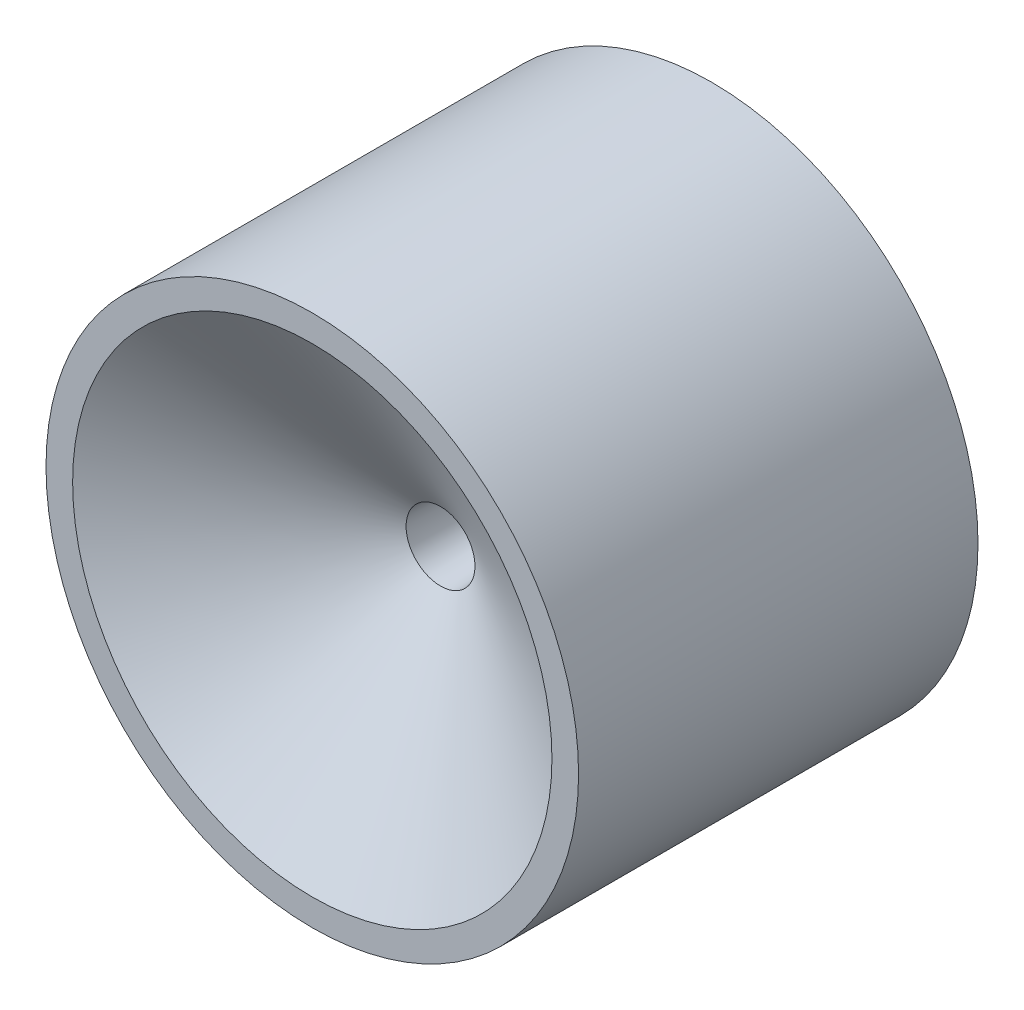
ISO-10303-21;
HEADER;
FILE_DESCRIPTION(('STEP AP214'),'2;1');
FILE_NAME('part.step','',(''),(''),'','','');
FILE_SCHEMA(('AUTOMOTIVE_DESIGN { 1 0 10303 214 1 1 1 1 }'));
ENDSEC;
DATA;
#1=APPLICATION_CONTEXT('core data for automotive mechanical design processes');
#2=APPLICATION_PROTOCOL_DEFINITION('international standard','automotive_design',2000,#1);
#3=PRODUCT_CONTEXT('',#1,'mechanical');
#4=PRODUCT('Part','Part','',(#3));
#5=PRODUCT_RELATED_PRODUCT_CATEGORY('part','',(#4));
#6=PRODUCT_DEFINITION_FORMATION('','',#4);
#7=PRODUCT_DEFINITION_CONTEXT('part definition',#1,'design');
#8=PRODUCT_DEFINITION('design','',#6,#7);
#9=PRODUCT_DEFINITION_SHAPE('','',#8);
#10=(LENGTH_UNIT() NAMED_UNIT(*) SI_UNIT(.MILLI.,.METRE.));
#11=(NAMED_UNIT(*) PLANE_ANGLE_UNIT() SI_UNIT($,.RADIAN.));
#12=(NAMED_UNIT(*) SI_UNIT($,.STERADIAN.) SOLID_ANGLE_UNIT());
#13=UNCERTAINTY_MEASURE_WITH_UNIT(LENGTH_MEASURE(1.E-05),#10,'distance_accuracy_value','');
#14=(GEOMETRIC_REPRESENTATION_CONTEXT(3) GLOBAL_UNCERTAINTY_ASSIGNED_CONTEXT((#13)) GLOBAL_UNIT_ASSIGNED_CONTEXT((#10,
#11,#12)) REPRESENTATION_CONTEXT('',''));
#15=CARTESIAN_POINT('',(0.,0.,0.));
#16=DIRECTION('',(0.,0.,1.));
#17=DIRECTION('',(1.,0.,0.));
#18=AXIS2_PLACEMENT_3D('',#15,#16,#17);
#19=CARTESIAN_POINT('',(0.,0.,0.));
#20=DIRECTION('',(0.,0.,1.));
#21=DIRECTION('',(1.,0.,0.));
#22=AXIS2_PLACEMENT_3D('',#19,#20,#21);
#23=PLANE('',#22);
#24=CARTESIAN_POINT('',(0.,0.,0.));
#25=DIRECTION('',(0.,0.,1.));
#26=DIRECTION('',(1.,0.,0.));
#27=AXIS2_PLACEMENT_3D('',#24,#25,#26);
#28=CIRCLE('',#27,3.4);
#29=CARTESIAN_POINT('',(3.4,0.,0.));
#30=VERTEX_POINT('',#29);
#31=EDGE_CURVE('E46',#30,#30,#28,.T.);
#32=ORIENTED_EDGE('',*,*,#31,.T.);
#33=EDGE_LOOP('',(#32));
#34=FACE_BOUND('',#33,.T.);
#35=CARTESIAN_POINT('',(0.,0.,0.));
#36=DIRECTION('',(0.,0.,-1.));
#37=DIRECTION('',(-1.,0.,0.));
#38=AXIS2_PLACEMENT_3D('',#35,#36,#37);
#39=CIRCLE('',#38,5.5);
#40=CARTESIAN_POINT('',(-5.5,0.,0.));
#41=VERTEX_POINT('',#40);
#42=EDGE_CURVE('E64',#41,#41,#39,.T.);
#43=ORIENTED_EDGE('',*,*,#42,.T.);
#44=EDGE_LOOP('',(#43));
#45=FACE_BOUND('',#44,.T.);
#46=ADVANCED_FACE('F31',(#34,#45),#23,.F.);
#47=CARTESIAN_POINT('',(0.,0.,0.));
#48=DIRECTION('',(0.,0.,-1.));
#49=DIRECTION('',(-1.,0.,0.));
#50=AXIS2_PLACEMENT_3D('',#47,#48,#49);
#51=CIRCLE('',#50,9.);
#52=CARTESIAN_POINT('',(-9.,0.,0.));
#53=VERTEX_POINT('',#52);
#54=EDGE_CURVE('E58',#53,#53,#51,.T.);
#55=ORIENTED_EDGE('',*,*,#54,.F.);
#56=EDGE_LOOP('',(#55));
#57=FACE_BOUND('',#56,.T.);
#58=CARTESIAN_POINT('',(0.,0.,0.));
#59=DIRECTION('',(0.,0.,1.));
#60=DIRECTION('',(1.,0.,0.));
#61=AXIS2_PLACEMENT_3D('',#58,#59,#60);
#62=CIRCLE('',#61,10.);
#63=CARTESIAN_POINT('',(10.,0.,0.));
#64=VERTEX_POINT('',#63);
#65=EDGE_CURVE('E39',#64,#64,#62,.T.);
#66=ORIENTED_EDGE('',*,*,#65,.F.);
#67=EDGE_LOOP('',(#66));
#68=FACE_BOUND('',#67,.T.);
#69=ADVANCED_FACE('F86',(#57,#68),#23,.F.);
#70=CARTESIAN_POINT('',(0.,0.,15.));
#71=DIRECTION('',(0.,0.,-1.));
#72=DIRECTION('',(-1.,0.,0.));
#73=AXIS2_PLACEMENT_3D('',#70,#71,#72);
#74=CYLINDRICAL_SURFACE('',#73,10.);
#75=CARTESIAN_POINT('',(0.,0.,15.));
#76=DIRECTION('',(0.,0.,1.));
#77=DIRECTION('',(1.,0.,0.));
#78=AXIS2_PLACEMENT_3D('',#75,#76,#77);
#79=CIRCLE('',#78,10.);
#80=CARTESIAN_POINT('',(10.,0.,15.));
#81=VERTEX_POINT('',#80);
#82=EDGE_CURVE('E10',#81,#81,#79,.T.);
#83=ORIENTED_EDGE('',*,*,#82,.F.);
#84=EDGE_LOOP('',(#83));
#85=FACE_BOUND('',#84,.T.);
#86=ORIENTED_EDGE('',*,*,#65,.T.);
#87=EDGE_LOOP('',(#86));
#88=FACE_BOUND('',#87,.T.);
#89=ADVANCED_FACE('F33',(#85,#88),#74,.T.);
#90=CARTESIAN_POINT('',(0.,0.,15.));
#91=DIRECTION('',(0.,0.,1.));
#92=DIRECTION('',(1.,0.,0.));
#93=AXIS2_PLACEMENT_3D('',#90,#91,#92);
#94=PLANE('',#93);
#95=CARTESIAN_POINT('',(0.,0.,15.));
#96=DIRECTION('',(0.,0.,1.));
#97=DIRECTION('',(1.,0.,0.));
#98=AXIS2_PLACEMENT_3D('',#95,#96,#97);
#99=CIRCLE('',#98,9.);
#100=CARTESIAN_POINT('',(9.,0.,15.));
#101=VERTEX_POINT('',#100);
#102=EDGE_CURVE('E54',#101,#101,#99,.T.);
#103=ORIENTED_EDGE('',*,*,#102,.F.);
#104=EDGE_LOOP('',(#103));
#105=FACE_BOUND('',#104,.T.);
#106=ORIENTED_EDGE('',*,*,#82,.T.);
#107=EDGE_LOOP('',(#106));
#108=FACE_BOUND('',#107,.T.);
#109=ADVANCED_FACE('F92',(#105,#108),#94,.T.);
#110=CARTESIAN_POINT('',(0.,0.,8.));
#111=DIRECTION('',(0.,0.,-1.));
#112=DIRECTION('',(-1.,0.,0.));
#113=AXIS2_PLACEMENT_3D('',#110,#111,#112);
#114=CYLINDRICAL_SURFACE('',#113,3.4);
#115=CARTESIAN_POINT('',(0.,0.,8.));
#116=DIRECTION('',(0.,0.,1.));
#117=DIRECTION('',(1.,0.,0.));
#118=AXIS2_PLACEMENT_3D('',#115,#116,#117);
#119=CIRCLE('',#118,3.4);
#120=CARTESIAN_POINT('',(3.4,0.,8.));
#121=VERTEX_POINT('',#120);
#122=EDGE_CURVE('E44',#121,#121,#119,.T.);
#123=ORIENTED_EDGE('',*,*,#122,.T.);
#124=EDGE_LOOP('',(#123));
#125=FACE_BOUND('',#124,.T.);
#126=ORIENTED_EDGE('',*,*,#31,.F.);
#127=EDGE_LOOP('',(#126));
#128=FACE_BOUND('',#127,.T.);
#129=ADVANCED_FACE('F97',(#125,#128),#114,.F.);
#130=CARTESIAN_POINT('',(0.,0.,8.));
#131=DIRECTION('',(0.,0.,1.));
#132=DIRECTION('',(1.,0.,0.));
#133=AXIS2_PLACEMENT_3D('',#130,#131,#132);
#134=PLANE('',#133);
#135=CARTESIAN_POINT('',(0.,0.,8.));
#136=DIRECTION('',(0.,0.,-1.));
#137=DIRECTION('',(-1.,0.,0.));
#138=AXIS2_PLACEMENT_3D('',#135,#136,#137);
#139=CIRCLE('',#138,1.2);
#140=CARTESIAN_POINT('',(-1.2,0.,8.));
#141=VERTEX_POINT('',#140);
#142=EDGE_CURVE('E49',#141,#141,#139,.T.);
#143=ORIENTED_EDGE('',*,*,#142,.F.);
#144=EDGE_LOOP('',(#143));
#145=FACE_BOUND('',#144,.T.);
#146=ORIENTED_EDGE('',*,*,#122,.F.);
#147=EDGE_LOOP('',(#146));
#148=FACE_BOUND('',#147,.T.);
#149=ADVANCED_FACE('F108',(#145,#148),#134,.F.);
#150=CARTESIAN_POINT('',(0.,0.,8.));
#151=DIRECTION('',(0.,0.,1.));
#152=DIRECTION('',(-1.,0.,0.));
#153=AXIS2_PLACEMENT_3D('',#150,#151,#152);
#154=CONICAL_SURFACE('',#153,1.2,0.0427605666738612);
#155=CARTESIAN_POINT('',(0.,0.,10.1844219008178));
#156=DIRECTION('',(0.,0.,1.));
#157=DIRECTION('',(1.,0.,0.));
#158=AXIS2_PLACEMENT_3D('',#155,#156,#157);
#159=CIRCLE('',#158,1.2934640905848);
#160=CARTESIAN_POINT('',(1.2934640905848,0.,10.1844219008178));
#161=VERTEX_POINT('',#160);
#162=EDGE_CURVE('E35',#161,#161,#159,.T.);
#163=ORIENTED_EDGE('',*,*,#162,.T.);
#164=EDGE_LOOP('',(#163));
#165=FACE_BOUND('',#164,.T.);
#166=ORIENTED_EDGE('',*,*,#142,.T.);
#167=EDGE_LOOP('',(#166));
#168=FACE_BOUND('',#167,.T.);
#169=ADVANCED_FACE('F112',(#165,#168),#154,.F.);
#170=CARTESIAN_POINT('',(0.,0.,15.));
#171=DIRECTION('',(0.,0.,1.));
#172=DIRECTION('',(1.,0.,0.));
#173=AXIS2_PLACEMENT_3D('',#170,#171,#172);
#174=CONICAL_SURFACE('',#173,9.,1.01229096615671);
#175=CARTESIAN_POINT('',(9.,0.,15.));
#176=CARTESIAN_POINT('',(8.91972358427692,0.,14.9498377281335));
#177=CARTESIAN_POINT('',(8.83944716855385,0.,14.899675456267));
#178=CARTESIAN_POINT('',(8.6788943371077,0.,14.7993509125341));
#179=CARTESIAN_POINT('',(8.59861792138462,0.,14.7491886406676));
#180=CARTESIAN_POINT('',(8.43806508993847,0.,14.6488640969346));
#181=CARTESIAN_POINT('',(8.3577886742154,0.,14.5987018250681));
#182=CARTESIAN_POINT('',(8.19723584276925,0.,14.4983772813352));
#183=CARTESIAN_POINT('',(8.11695942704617,0.,14.4482150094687));
#184=CARTESIAN_POINT('',(7.95640659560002,0.,14.3478904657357));
#185=CARTESIAN_POINT('',(7.87613017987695,0.,14.2977281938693));
#186=CARTESIAN_POINT('',(7.7155773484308,0.,14.1974036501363));
#187=CARTESIAN_POINT('',(7.63530093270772,0.,14.1472413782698));
#188=CARTESIAN_POINT('',(7.47474810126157,0.,14.0469168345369));
#189=CARTESIAN_POINT('',(7.3944716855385,0.,13.9967545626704));
#190=CARTESIAN_POINT('',(7.23391885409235,0.,13.8964300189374));
#191=CARTESIAN_POINT('',(7.15364243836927,0.,13.8462677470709));
#192=CARTESIAN_POINT('',(6.99308960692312,0.,13.745943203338));
#193=CARTESIAN_POINT('',(6.91281319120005,0.,13.6957809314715));
#194=CARTESIAN_POINT('',(6.7522603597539,0.,13.5954563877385));
#195=CARTESIAN_POINT('',(6.67198394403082,0.,13.545294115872));
#196=CARTESIAN_POINT('',(6.51143111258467,0.,13.4449695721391));
#197=CARTESIAN_POINT('',(6.4311546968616,0.,13.3948073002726));
#198=CARTESIAN_POINT('',(6.27060186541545,0.,13.2944827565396));
#199=CARTESIAN_POINT('',(6.19032544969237,0.,13.2443204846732));
#200=CARTESIAN_POINT('',(6.02977261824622,0.,13.1439959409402));
#201=CARTESIAN_POINT('',(5.94949620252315,0.,13.0938336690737));
#202=CARTESIAN_POINT('',(5.788943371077,0.,12.9935091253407));
#203=CARTESIAN_POINT('',(5.70866695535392,0.,12.9433468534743));
#204=CARTESIAN_POINT('',(5.54811412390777,0.,12.8430223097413));
#205=CARTESIAN_POINT('',(5.4678377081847,0.,12.7928600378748));
#206=CARTESIAN_POINT('',(5.30728487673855,0.,12.6925354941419));
#207=CARTESIAN_POINT('',(5.22700846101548,0.,12.6423732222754));
#208=CARTESIAN_POINT('',(5.06645562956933,0.,12.5420486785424));
#209=CARTESIAN_POINT('',(4.98617921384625,0.,12.4918864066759));
#210=CARTESIAN_POINT('',(4.8256263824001,0.,12.391561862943));
#211=CARTESIAN_POINT('',(4.74534996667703,0.,12.3413995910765));
#212=CARTESIAN_POINT('',(4.58479713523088,0.,12.2410750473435));
#213=CARTESIAN_POINT('',(4.5045207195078,0.,12.190912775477));
#214=CARTESIAN_POINT('',(4.34396788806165,0.,12.0905882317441));
#215=CARTESIAN_POINT('',(4.26369147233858,0.,12.0404259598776));
#216=CARTESIAN_POINT('',(4.10313864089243,0.,11.9401014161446));
#217=CARTESIAN_POINT('',(4.02286222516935,0.,11.8899391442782));
#218=CARTESIAN_POINT('',(3.8623093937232,0.,11.7896146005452));
#219=CARTESIAN_POINT('',(3.78203297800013,0.,11.7394523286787));
#220=CARTESIAN_POINT('',(3.62148014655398,0.,11.6391277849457));
#221=CARTESIAN_POINT('',(3.5412037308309,0.,11.5889655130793));
#222=CARTESIAN_POINT('',(3.38065089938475,0.,11.4886409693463));
#223=CARTESIAN_POINT('',(3.30037448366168,0.,11.4384786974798));
#224=CARTESIAN_POINT('',(3.13982165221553,0.,11.3381541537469));
#225=CARTESIAN_POINT('',(3.05954523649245,0.,11.2879918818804));
#226=CARTESIAN_POINT('',(2.8989924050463,0.,11.1876673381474));
#227=CARTESIAN_POINT('',(2.81871598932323,0.,11.1375050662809));
#228=CARTESIAN_POINT('',(2.65816315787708,0.,11.037180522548));
#229=CARTESIAN_POINT('',(2.577886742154,0.,10.9870182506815));
#230=CARTESIAN_POINT('',(2.41733391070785,0.,10.8866937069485));
#231=CARTESIAN_POINT('',(2.33705749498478,0.,10.836531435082));
#232=CARTESIAN_POINT('',(2.17650466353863,0.,10.7362068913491));
#233=CARTESIAN_POINT('',(2.09622824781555,0.,10.6860446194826));
#234=CARTESIAN_POINT('',(1.9356754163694,0.,10.5857200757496));
#235=CARTESIAN_POINT('',(1.85539900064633,0.,10.5355578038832));
#236=CARTESIAN_POINT('',(1.69484616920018,0.,10.4352332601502));
#237=CARTESIAN_POINT('',(1.6145697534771,0.,10.3850709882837));
#238=CARTESIAN_POINT('',(1.45401692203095,0.,10.2847464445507));
#239=CARTESIAN_POINT('',(1.37374050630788,0.,10.2345841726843));
#240=CARTESIAN_POINT('',(1.2934640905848,0.,10.1844219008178));
#241=B_SPLINE_CURVE_WITH_KNOTS('',3,(#175,#176,#177,#178,#179,#180,#181,#182,#183,#184,#185,
#186,#187,#188,#189,#190,#191,#192,#193,#194,#195,#196,#197,#198,#199,#200,#201,#202,#203,#204,
#205,#206,#207,#208,#209,#210,#211,#212,#213,#214,#215,#216,#217,#218,#219,#220,#221,#222,#223,
#224,#225,#226,#227,#228,#229,#230,#231,#232,#233,#234,#235,#236,#237,#238,#239,#240),
.UNSPECIFIED.,.F.,.F.,(4,2,2,2,2,2,2,2,2,2,2,2,2,2,2,2,2,2,2,2,2,2,2,2,2,2,2,2,2,2,2,2,4),(0.,
0.283980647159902,0.567961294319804,0.851941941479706,1.13592258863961,1.41990323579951,
1.70388388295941,1.98786453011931,2.27184517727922,2.55582582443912,2.83980647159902,
3.12378711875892,3.40776776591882,3.69174841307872,3.97572906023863,4.25970970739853,
4.54369035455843,4.82767100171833,5.11165164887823,5.39563229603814,5.67961294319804,
5.96359359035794,6.24757423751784,6.53155488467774,6.81553553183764,7.09951617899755,
7.38349682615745,7.66747747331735,7.95145812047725,8.23543876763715,8.51941941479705,
8.80340006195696,9.08738070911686),.UNSPECIFIED.);
#242=EDGE_CURVE('BSEAM82',#101,#161,#241,.T.);
#243=ORIENTED_EDGE('',*,*,#102,.T.);
#244=ORIENTED_EDGE('',*,*,#162,.F.);
#245=ORIENTED_EDGE('',*,*,#242,.T.);
#246=ORIENTED_EDGE('',*,*,#242,.F.);
#247=EDGE_LOOP('',(#243,#245,#244,#246));
#248=FACE_BOUND('',#247,.T.);
#249=ADVANCED_FACE('F82',(#248),#174,.F.);
#250=CARTESIAN_POINT('',(0.,0.,12.));
#251=DIRECTION('',(0.,0.,-1.));
#252=DIRECTION('',(-1.,0.,0.));
#253=AXIS2_PLACEMENT_3D('',#250,#251,#252);
#254=CYLINDRICAL_SURFACE('',#253,9.);
#255=CARTESIAN_POINT('',(0.,0.,12.));
#256=DIRECTION('',(0.,0.,-1.));
#257=DIRECTION('',(-1.,0.,0.));
#258=AXIS2_PLACEMENT_3D('',#255,#256,#257);
#259=CIRCLE('',#258,9.);
#260=CARTESIAN_POINT('',(-9.,0.,12.));
#261=VERTEX_POINT('',#260);
#262=EDGE_CURVE('E57',#261,#261,#259,.T.);
#263=ORIENTED_EDGE('',*,*,#262,.F.);
#264=EDGE_LOOP('',(#263));
#265=FACE_BOUND('',#264,.T.);
#266=ORIENTED_EDGE('',*,*,#54,.T.);
#267=EDGE_LOOP('',(#266));
#268=FACE_BOUND('',#267,.T.);
#269=ADVANCED_FACE('F76',(#265,#268),#254,.F.);
#270=CARTESIAN_POINT('',(0.,0.,12.));
#271=DIRECTION('',(0.,0.,-1.));
#272=DIRECTION('',(-1.,0.,0.));
#273=AXIS2_PLACEMENT_3D('',#270,#271,#272);
#274=PLANE('',#273);
#275=CARTESIAN_POINT('',(0.,0.,12.));
#276=DIRECTION('',(0.,0.,-1.));
#277=DIRECTION('',(-1.,0.,0.));
#278=AXIS2_PLACEMENT_3D('',#275,#276,#277);
#279=CIRCLE('',#278,5.5);
#280=CARTESIAN_POINT('',(-5.5,0.,12.));
#281=VERTEX_POINT('',#280);
#282=EDGE_CURVE('E61',#281,#281,#279,.T.);
#283=ORIENTED_EDGE('',*,*,#282,.F.);
#284=EDGE_LOOP('',(#283));
#285=FACE_BOUND('',#284,.T.);
#286=ORIENTED_EDGE('',*,*,#262,.T.);
#287=EDGE_LOOP('',(#286));
#288=FACE_BOUND('',#287,.T.);
#289=ADVANCED_FACE('F73',(#285,#288),#274,.T.);
#290=CARTESIAN_POINT('',(0.,0.,12.));
#291=DIRECTION('',(0.,0.,-1.));
#292=DIRECTION('',(-1.,0.,0.));
#293=AXIS2_PLACEMENT_3D('',#290,#291,#292);
#294=CYLINDRICAL_SURFACE('',#293,5.5);
#295=ORIENTED_EDGE('',*,*,#282,.T.);
#296=EDGE_LOOP('',(#295));
#297=FACE_BOUND('',#296,.T.);
#298=ORIENTED_EDGE('',*,*,#42,.F.);
#299=EDGE_LOOP('',(#298));
#300=FACE_BOUND('',#299,.T.);
#301=ADVANCED_FACE('F70',(#297,#300),#294,.T.);
#302=CLOSED_SHELL('',(#46,#69,#89,#109,#129,#149,#169,#249,#269,#289,#301));
#303=MANIFOLD_SOLID_BREP('B2',#302);
#304=ADVANCED_BREP_SHAPE_REPRESENTATION('',(#18,#303),#14);
#305=SHAPE_DEFINITION_REPRESENTATION(#9,#304);
ENDSEC;
END-ISO-10303-21;
